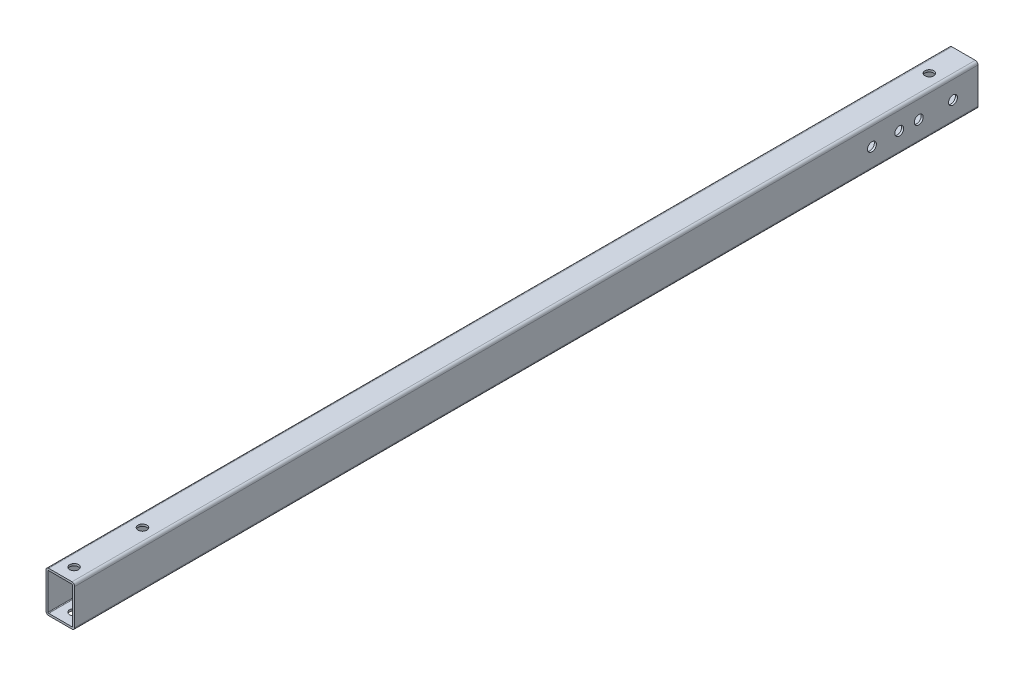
ISO-10303-21;
HEADER;
FILE_DESCRIPTION(('STEP AP214'),'2;1');
FILE_NAME('part.step','',(''),(''),'','','');
FILE_SCHEMA(('AUTOMOTIVE_DESIGN { 1 0 10303 214 1 1 1 1 }'));
ENDSEC;
DATA;
#1=APPLICATION_CONTEXT('core data for automotive mechanical design processes');
#2=APPLICATION_PROTOCOL_DEFINITION('international standard','automotive_design',2000,#1);
#3=PRODUCT_CONTEXT('',#1,'mechanical');
#4=PRODUCT('Part','Part','',(#3));
#5=PRODUCT_RELATED_PRODUCT_CATEGORY('part','',(#4));
#6=PRODUCT_DEFINITION_FORMATION('','',#4);
#7=PRODUCT_DEFINITION_CONTEXT('part definition',#1,'design');
#8=PRODUCT_DEFINITION('design','',#6,#7);
#9=PRODUCT_DEFINITION_SHAPE('','',#8);
#10=(LENGTH_UNIT() NAMED_UNIT(*) SI_UNIT(.MILLI.,.METRE.));
#11=(NAMED_UNIT(*) PLANE_ANGLE_UNIT() SI_UNIT($,.RADIAN.));
#12=(NAMED_UNIT(*) SI_UNIT($,.STERADIAN.) SOLID_ANGLE_UNIT());
#13=UNCERTAINTY_MEASURE_WITH_UNIT(LENGTH_MEASURE(1.E-05),#10,'distance_accuracy_value','');
#14=(GEOMETRIC_REPRESENTATION_CONTEXT(3) GLOBAL_UNCERTAINTY_ASSIGNED_CONTEXT((#13)) GLOBAL_UNIT_ASSIGNED_CONTEXT((#10,
#11,#12)) REPRESENTATION_CONTEXT('',''));
#15=CARTESIAN_POINT('',(0.,0.,0.));
#16=DIRECTION('',(0.,0.,1.));
#17=DIRECTION('',(1.,0.,0.));
#18=AXIS2_PLACEMENT_3D('',#15,#16,#17);
#19=CARTESIAN_POINT('',(-94.5000000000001,-13.,-660.));
#20=DIRECTION('',(0.,0.,1.));
#21=DIRECTION('',(1.,0.,0.));
#22=AXIS2_PLACEMENT_3D('',#19,#20,#21);
#23=CYLINDRICAL_SURFACE('',#22,2.);
#24=CARTESIAN_POINT('',(-94.5000000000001,-13.,0.));
#25=DIRECTION('',(0.,0.,1.));
#26=DIRECTION('',(-1.,0.,0.));
#27=AXIS2_PLACEMENT_3D('',#24,#25,#26);
#28=CIRCLE('',#27,2.);
#29=CARTESIAN_POINT('',(-96.5000000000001,-13.,0.));
#30=VERTEX_POINT('',#29);
#31=CARTESIAN_POINT('',(-94.5000000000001,-15.,0.));
#32=VERTEX_POINT('',#31);
#33=EDGE_CURVE('E201',#30,#32,#28,.T.);
#34=ORIENTED_EDGE('',*,*,#33,.F.);
#35=DIRECTION('',(0.,0.,1.));
#36=VECTOR('',#35,1.);
#37=CARTESIAN_POINT('',(-96.5000000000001,-13.,-660.));
#38=LINE('',#37,#36);
#39=CARTESIAN_POINT('',(-96.5000000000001,-13.,-660.));
#40=VERTEX_POINT('',#39);
#41=EDGE_CURVE('E11',#40,#30,#38,.T.);
#42=ORIENTED_EDGE('',*,*,#41,.F.);
#43=CARTESIAN_POINT('',(-94.5000000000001,-13.,-660.));
#44=DIRECTION('',(0.,0.,1.));
#45=DIRECTION('',(-1.,0.,0.));
#46=AXIS2_PLACEMENT_3D('',#43,#44,#45);
#47=CIRCLE('',#46,2.);
#48=CARTESIAN_POINT('',(-94.5000000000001,-15.,-660.));
#49=VERTEX_POINT('',#48);
#50=EDGE_CURVE('E235',#40,#49,#47,.T.);
#51=ORIENTED_EDGE('',*,*,#50,.T.);
#52=DIRECTION('',(0.,0.,1.));
#53=VECTOR('',#52,1.);
#54=CARTESIAN_POINT('',(-94.5000000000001,-15.,-660.));
#55=LINE('',#54,#53);
#56=EDGE_CURVE('E258',#49,#32,#55,.T.);
#57=ORIENTED_EDGE('',*,*,#56,.T.);
#58=EDGE_LOOP('',(#34,#42,#51,#57));
#59=FACE_BOUND('',#58,.T.);
#60=ADVANCED_FACE('F29',(#59),#23,.T.);
#61=CARTESIAN_POINT('',(-96.5000000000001,-13.,-660.));
#62=DIRECTION('',(-1.,0.,0.));
#63=DIRECTION('',(0.,0.,1.));
#64=AXIS2_PLACEMENT_3D('',#61,#62,#63);
#65=PLANE('',#64);
#66=CARTESIAN_POINT('',(-96.5000000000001,0.,-582.5));
#67=DIRECTION('',(-1.,0.,0.));
#68=DIRECTION('',(0.,0.,1.));
#69=AXIS2_PLACEMENT_3D('',#66,#67,#68);
#70=CIRCLE('',#69,3.24999999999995);
#71=CARTESIAN_POINT('',(-96.5000000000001,0.,-579.25));
#72=VERTEX_POINT('',#71);
#73=EDGE_CURVE('E325',#72,#72,#70,.T.);
#74=ORIENTED_EDGE('',*,*,#73,.F.);
#75=EDGE_LOOP('',(#74));
#76=FACE_BOUND('',#75,.T.);
#77=CARTESIAN_POINT('',(-96.5,0.,-602.5));
#78=DIRECTION('',(-1.,0.,0.));
#79=DIRECTION('',(0.,0.,1.));
#80=AXIS2_PLACEMENT_3D('',#77,#78,#79);
#81=CIRCLE('',#80,3.24999999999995);
#82=CARTESIAN_POINT('',(-96.5,0.,-599.25));
#83=VERTEX_POINT('',#82);
#84=EDGE_CURVE('E332',#83,#83,#81,.T.);
#85=ORIENTED_EDGE('',*,*,#84,.F.);
#86=EDGE_LOOP('',(#85));
#87=FACE_BOUND('',#86,.T.);
#88=CARTESIAN_POINT('',(-96.5000000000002,0.,-616.710580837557));
#89=DIRECTION('',(-1.,0.,0.));
#90=DIRECTION('',(0.,0.,1.));
#91=AXIS2_PLACEMENT_3D('',#88,#89,#90);
#92=CIRCLE('',#91,3.24999999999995);
#93=CARTESIAN_POINT('',(-96.5000000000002,0.,-613.460580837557));
#94=VERTEX_POINT('',#93);
#95=EDGE_CURVE('E339',#94,#94,#92,.T.);
#96=ORIENTED_EDGE('',*,*,#95,.F.);
#97=EDGE_LOOP('',(#96));
#98=FACE_BOUND('',#97,.T.);
#99=CARTESIAN_POINT('',(-96.5000000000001,0.,-641.710580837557));
#100=DIRECTION('',(-1.,0.,0.));
#101=DIRECTION('',(0.,0.,1.));
#102=AXIS2_PLACEMENT_3D('',#99,#100,#101);
#103=CIRCLE('',#102,3.24999999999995);
#104=CARTESIAN_POINT('',(-96.5000000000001,0.,-638.460580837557));
#105=VERTEX_POINT('',#104);
#106=EDGE_CURVE('E346',#105,#105,#103,.T.);
#107=ORIENTED_EDGE('',*,*,#106,.F.);
#108=EDGE_LOOP('',(#107));
#109=FACE_BOUND('',#108,.T.);
#110=DIRECTION('',(0.,-1.,0.));
#111=VECTOR('',#110,1.);
#112=CARTESIAN_POINT('',(-96.5000000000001,-13.,0.));
#113=LINE('',#112,#111);
#114=CARTESIAN_POINT('',(-96.5000000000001,13.,0.));
#115=VERTEX_POINT('',#114);
#116=EDGE_CURVE('E232',#115,#30,#113,.T.);
#117=ORIENTED_EDGE('',*,*,#116,.F.);
#118=DIRECTION('',(0.,0.,1.));
#119=VECTOR('',#118,1.);
#120=CARTESIAN_POINT('',(-96.5000000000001,13.,-660.));
#121=LINE('',#120,#119);
#122=CARTESIAN_POINT('',(-96.5000000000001,13.,-660.));
#123=VERTEX_POINT('',#122);
#124=EDGE_CURVE('E37',#123,#115,#121,.T.);
#125=ORIENTED_EDGE('',*,*,#124,.F.);
#126=DIRECTION('',(0.,-1.,0.));
#127=VECTOR('',#126,1.);
#128=CARTESIAN_POINT('',(-96.5000000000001,-13.,-660.));
#129=LINE('',#128,#127);
#130=EDGE_CURVE('E256',#123,#40,#129,.T.);
#131=ORIENTED_EDGE('',*,*,#130,.T.);
#132=ORIENTED_EDGE('',*,*,#41,.T.);
#133=EDGE_LOOP('',(#117,#125,#131,#132));
#134=FACE_BOUND('',#133,.T.);
#135=ADVANCED_FACE('F353',(#76,#87,#98,#109,#134),#65,.T.);
#136=CARTESIAN_POINT('',(-94.5000000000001,13.,-660.));
#137=DIRECTION('',(0.,0.,1.));
#138=DIRECTION('',(1.,0.,0.));
#139=AXIS2_PLACEMENT_3D('',#136,#137,#138);
#140=CYLINDRICAL_SURFACE('',#139,2.);
#141=CARTESIAN_POINT('',(-94.5000000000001,13.,0.));
#142=DIRECTION('',(0.,0.,1.));
#143=DIRECTION('',(-1.,0.,0.));
#144=AXIS2_PLACEMENT_3D('',#141,#142,#143);
#145=CIRCLE('',#144,2.);
#146=CARTESIAN_POINT('',(-94.5000000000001,15.,0.));
#147=VERTEX_POINT('',#146);
#148=EDGE_CURVE('E229',#147,#115,#145,.T.);
#149=ORIENTED_EDGE('',*,*,#148,.F.);
#150=DIRECTION('',(0.,0.,1.));
#151=VECTOR('',#150,1.);
#152=CARTESIAN_POINT('',(-94.5000000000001,15.,-660.));
#153=LINE('',#152,#151);
#154=CARTESIAN_POINT('',(-94.5000000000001,15.,-660.));
#155=VERTEX_POINT('',#154);
#156=EDGE_CURVE('E261',#155,#147,#153,.T.);
#157=ORIENTED_EDGE('',*,*,#156,.F.);
#158=CARTESIAN_POINT('',(-94.5000000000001,13.,-660.));
#159=DIRECTION('',(0.,0.,1.));
#160=DIRECTION('',(-1.,0.,0.));
#161=AXIS2_PLACEMENT_3D('',#158,#159,#160);
#162=CIRCLE('',#161,2.);
#163=EDGE_CURVE('E253',#155,#123,#162,.T.);
#164=ORIENTED_EDGE('',*,*,#163,.T.);
#165=ORIENTED_EDGE('',*,*,#124,.T.);
#166=EDGE_LOOP('',(#149,#157,#164,#165));
#167=FACE_BOUND('',#166,.T.);
#168=ADVANCED_FACE('F356',(#167),#140,.T.);
#169=CARTESIAN_POINT('',(-77.5000000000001,15.,-660.));
#170=DIRECTION('',(0.,1.,0.));
#171=DIRECTION('',(0.,0.,1.));
#172=AXIS2_PLACEMENT_3D('',#169,#170,#171);
#173=PLANE('',#172);
#174=CARTESIAN_POINT('',(-86.,15.,-635.));
#175=DIRECTION('',(0.,1.,0.));
#176=DIRECTION('',(0.,0.,1.));
#177=AXIS2_PLACEMENT_3D('',#174,#175,#176);
#178=CIRCLE('',#177,3.24999999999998);
#179=CARTESIAN_POINT('',(-86.,15.,-631.75));
#180=VERTEX_POINT('',#179);
#181=EDGE_CURVE('E683',#180,#180,#178,.T.);
#182=ORIENTED_EDGE('',*,*,#181,.F.);
#183=EDGE_LOOP('',(#182));
#184=FACE_BOUND('',#183,.T.);
#185=CARTESIAN_POINT('',(-85.9999999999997,15.,-60.));
#186=DIRECTION('',(0.,1.,0.));
#187=DIRECTION('',(0.,0.,1.));
#188=AXIS2_PLACEMENT_3D('',#185,#186,#187);
#189=CIRCLE('',#188,3.25000000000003);
#190=CARTESIAN_POINT('',(-85.9999999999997,15.,-56.75));
#191=VERTEX_POINT('',#190);
#192=EDGE_CURVE('E306',#191,#191,#189,.T.);
#193=ORIENTED_EDGE('',*,*,#192,.F.);
#194=EDGE_LOOP('',(#193));
#195=FACE_BOUND('',#194,.T.);
#196=CARTESIAN_POINT('',(-86.,15.,-9.9999999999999));
#197=DIRECTION('',(0.,1.,0.));
#198=DIRECTION('',(0.,0.,1.));
#199=AXIS2_PLACEMENT_3D('',#196,#197,#198);
#200=CIRCLE('',#199,3.25);
#201=CARTESIAN_POINT('',(-86.,15.,-6.7499999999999));
#202=VERTEX_POINT('',#201);
#203=EDGE_CURVE('E303',#202,#202,#200,.T.);
#204=ORIENTED_EDGE('',*,*,#203,.F.);
#205=EDGE_LOOP('',(#204));
#206=FACE_BOUND('',#205,.T.);
#207=DIRECTION('',(-1.,0.,0.));
#208=VECTOR('',#207,1.);
#209=CARTESIAN_POINT('',(-77.5000000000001,15.,0.));
#210=LINE('',#209,#208);
#211=CARTESIAN_POINT('',(-77.5000000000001,15.,0.));
#212=VERTEX_POINT('',#211);
#213=EDGE_CURVE('E226',#212,#147,#210,.T.);
#214=ORIENTED_EDGE('',*,*,#213,.F.);
#215=DIRECTION('',(0.,0.,1.));
#216=VECTOR('',#215,1.);
#217=CARTESIAN_POINT('',(-77.5000000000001,15.,-660.));
#218=LINE('',#217,#216);
#219=CARTESIAN_POINT('',(-77.5000000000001,15.,-660.));
#220=VERTEX_POINT('',#219);
#221=EDGE_CURVE('E263',#220,#212,#218,.T.);
#222=ORIENTED_EDGE('',*,*,#221,.F.);
#223=DIRECTION('',(-1.,0.,0.));
#224=VECTOR('',#223,1.);
#225=CARTESIAN_POINT('',(-77.5000000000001,15.,-660.));
#226=LINE('',#225,#224);
#227=EDGE_CURVE('E250',#220,#155,#226,.T.);
#228=ORIENTED_EDGE('',*,*,#227,.T.);
#229=ORIENTED_EDGE('',*,*,#156,.T.);
#230=EDGE_LOOP('',(#214,#222,#228,#229));
#231=FACE_BOUND('',#230,.T.);
#232=ADVANCED_FACE('F388',(#184,#195,#206,#231),#173,.T.);
#233=CARTESIAN_POINT('',(-77.5000000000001,13.,-660.));
#234=DIRECTION('',(0.,0.,1.));
#235=DIRECTION('',(1.,0.,0.));
#236=AXIS2_PLACEMENT_3D('',#233,#234,#235);
#237=CYLINDRICAL_SURFACE('',#236,2.);
#238=CARTESIAN_POINT('',(-77.5000000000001,13.,0.));
#239=DIRECTION('',(0.,0.,1.));
#240=DIRECTION('',(-1.,0.,0.));
#241=AXIS2_PLACEMENT_3D('',#238,#239,#240);
#242=CIRCLE('',#241,2.);
#243=CARTESIAN_POINT('',(-75.5000000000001,13.,0.));
#244=VERTEX_POINT('',#243);
#245=EDGE_CURVE('E223',#244,#212,#242,.T.);
#246=ORIENTED_EDGE('',*,*,#245,.F.);
#247=DIRECTION('',(0.,0.,1.));
#248=VECTOR('',#247,1.);
#249=CARTESIAN_POINT('',(-75.5000000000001,13.,-660.));
#250=LINE('',#249,#248);
#251=CARTESIAN_POINT('',(-75.5000000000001,13.,-660.));
#252=VERTEX_POINT('',#251);
#253=EDGE_CURVE('E265',#252,#244,#250,.T.);
#254=ORIENTED_EDGE('',*,*,#253,.F.);
#255=CARTESIAN_POINT('',(-77.5000000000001,13.,-660.));
#256=DIRECTION('',(0.,0.,1.));
#257=DIRECTION('',(-1.,0.,0.));
#258=AXIS2_PLACEMENT_3D('',#255,#256,#257);
#259=CIRCLE('',#258,2.);
#260=EDGE_CURVE('E247',#252,#220,#259,.T.);
#261=ORIENTED_EDGE('',*,*,#260,.T.);
#262=ORIENTED_EDGE('',*,*,#221,.T.);
#263=EDGE_LOOP('',(#246,#254,#261,#262));
#264=FACE_BOUND('',#263,.T.);
#265=ADVANCED_FACE('F386',(#264),#237,.T.);
#266=CARTESIAN_POINT('',(-75.5000000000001,-13.,-660.));
#267=DIRECTION('',(1.,0.,0.));
#268=DIRECTION('',(0.,1.,0.));
#269=AXIS2_PLACEMENT_3D('',#266,#267,#268);
#270=PLANE('',#269);
#271=CARTESIAN_POINT('',(-75.5000000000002,0.,-582.5));
#272=DIRECTION('',(1.,0.,0.));
#273=DIRECTION('',(0.,1.,0.));
#274=AXIS2_PLACEMENT_3D('',#271,#272,#273);
#275=CIRCLE('',#274,3.24999999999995);
#276=CARTESIAN_POINT('',(-75.5000000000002,3.24999999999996,-582.5));
#277=VERTEX_POINT('',#276);
#278=EDGE_CURVE('E291',#277,#277,#275,.T.);
#279=ORIENTED_EDGE('',*,*,#278,.F.);
#280=EDGE_LOOP('',(#279));
#281=FACE_BOUND('',#280,.T.);
#282=CARTESIAN_POINT('',(-75.5,0.,-602.5));
#283=DIRECTION('',(1.,0.,0.));
#284=DIRECTION('',(0.,1.,0.));
#285=AXIS2_PLACEMENT_3D('',#282,#283,#284);
#286=CIRCLE('',#285,3.24999999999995);
#287=CARTESIAN_POINT('',(-75.5,3.24999999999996,-602.5));
#288=VERTEX_POINT('',#287);
#289=EDGE_CURVE('E286',#288,#288,#286,.T.);
#290=ORIENTED_EDGE('',*,*,#289,.F.);
#291=EDGE_LOOP('',(#290));
#292=FACE_BOUND('',#291,.T.);
#293=CARTESIAN_POINT('',(-75.5000000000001,0.,-616.710580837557));
#294=DIRECTION('',(1.,0.,0.));
#295=DIRECTION('',(0.,1.,0.));
#296=AXIS2_PLACEMENT_3D('',#293,#294,#295);
#297=CIRCLE('',#296,3.24999999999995);
#298=CARTESIAN_POINT('',(-75.5000000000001,3.24999999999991,-616.710580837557));
#299=VERTEX_POINT('',#298);
#300=EDGE_CURVE('E281',#299,#299,#297,.T.);
#301=ORIENTED_EDGE('',*,*,#300,.F.);
#302=EDGE_LOOP('',(#301));
#303=FACE_BOUND('',#302,.T.);
#304=CARTESIAN_POINT('',(-75.5000000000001,0.,-641.710580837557));
#305=DIRECTION('',(1.,0.,0.));
#306=DIRECTION('',(0.,1.,0.));
#307=AXIS2_PLACEMENT_3D('',#304,#305,#306);
#308=CIRCLE('',#307,3.24999999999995);
#309=CARTESIAN_POINT('',(-75.5000000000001,3.24999999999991,-641.710580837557));
#310=VERTEX_POINT('',#309);
#311=EDGE_CURVE('E276',#310,#310,#308,.T.);
#312=ORIENTED_EDGE('',*,*,#311,.F.);
#313=EDGE_LOOP('',(#312));
#314=FACE_BOUND('',#313,.T.);
#315=DIRECTION('',(0.,1.,0.));
#316=VECTOR('',#315,1.);
#317=CARTESIAN_POINT('',(-75.5000000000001,-13.,0.));
#318=LINE('',#317,#316);
#319=CARTESIAN_POINT('',(-75.5000000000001,-13.,0.));
#320=VERTEX_POINT('',#319);
#321=EDGE_CURVE('E220',#320,#244,#318,.T.);
#322=ORIENTED_EDGE('',*,*,#321,.F.);
#323=DIRECTION('',(0.,0.,1.));
#324=VECTOR('',#323,1.);
#325=CARTESIAN_POINT('',(-75.5000000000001,-13.,-660.));
#326=LINE('',#325,#324);
#327=CARTESIAN_POINT('',(-75.5000000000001,-13.,-660.));
#328=VERTEX_POINT('',#327);
#329=EDGE_CURVE('E267',#328,#320,#326,.T.);
#330=ORIENTED_EDGE('',*,*,#329,.F.);
#331=DIRECTION('',(0.,1.,0.));
#332=VECTOR('',#331,1.);
#333=CARTESIAN_POINT('',(-75.5000000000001,-13.,-660.));
#334=LINE('',#333,#332);
#335=EDGE_CURVE('E244',#328,#252,#334,.T.);
#336=ORIENTED_EDGE('',*,*,#335,.T.);
#337=ORIENTED_EDGE('',*,*,#253,.T.);
#338=EDGE_LOOP('',(#322,#330,#336,#337));
#339=FACE_BOUND('',#338,.T.);
#340=ADVANCED_FACE('F382',(#281,#292,#303,#314,#339),#270,.T.);
#341=CARTESIAN_POINT('',(-77.5000000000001,-13.,-660.));
#342=DIRECTION('',(0.,0.,1.));
#343=DIRECTION('',(1.,0.,0.));
#344=AXIS2_PLACEMENT_3D('',#341,#342,#343);
#345=CYLINDRICAL_SURFACE('',#344,2.);
#346=CARTESIAN_POINT('',(-77.5000000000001,-13.,0.));
#347=DIRECTION('',(0.,0.,1.));
#348=DIRECTION('',(-1.,0.,0.));
#349=AXIS2_PLACEMENT_3D('',#346,#347,#348);
#350=CIRCLE('',#349,2.);
#351=CARTESIAN_POINT('',(-77.5000000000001,-15.,0.));
#352=VERTEX_POINT('',#351);
#353=EDGE_CURVE('E217',#352,#320,#350,.T.);
#354=ORIENTED_EDGE('',*,*,#353,.F.);
#355=DIRECTION('',(0.,0.,1.));
#356=VECTOR('',#355,1.);
#357=CARTESIAN_POINT('',(-77.5000000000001,-15.,-660.));
#358=LINE('',#357,#356);
#359=CARTESIAN_POINT('',(-77.5000000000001,-15.,-660.));
#360=VERTEX_POINT('',#359);
#361=EDGE_CURVE('E269',#360,#352,#358,.T.);
#362=ORIENTED_EDGE('',*,*,#361,.F.);
#363=CARTESIAN_POINT('',(-77.5000000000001,-13.,-660.));
#364=DIRECTION('',(0.,0.,1.));
#365=DIRECTION('',(-1.,0.,0.));
#366=AXIS2_PLACEMENT_3D('',#363,#364,#365);
#367=CIRCLE('',#366,2.);
#368=EDGE_CURVE('E241',#360,#328,#367,.T.);
#369=ORIENTED_EDGE('',*,*,#368,.T.);
#370=ORIENTED_EDGE('',*,*,#329,.T.);
#371=EDGE_LOOP('',(#354,#362,#369,#370));
#372=FACE_BOUND('',#371,.T.);
#373=ADVANCED_FACE('F379',(#372),#345,.T.);
#374=CARTESIAN_POINT('',(-77.5000000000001,-15.,-660.));
#375=DIRECTION('',(0.,-1.,0.));
#376=DIRECTION('',(1.,0.,0.));
#377=AXIS2_PLACEMENT_3D('',#374,#375,#376);
#378=PLANE('',#377);
#379=CARTESIAN_POINT('',(-86.,-15.,-635.));
#380=DIRECTION('',(0.,1.,0.));
#381=DIRECTION('',(0.,0.,1.));
#382=AXIS2_PLACEMENT_3D('',#379,#380,#381);
#383=CIRCLE('',#382,3.24999999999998);
#384=CARTESIAN_POINT('',(-86.,-15.,-631.75));
#385=VERTEX_POINT('',#384);
#386=EDGE_CURVE('E677',#385,#385,#383,.T.);
#387=ORIENTED_EDGE('',*,*,#386,.T.);
#388=EDGE_LOOP('',(#387));
#389=FACE_BOUND('',#388,.T.);
#390=CARTESIAN_POINT('',(-85.9999999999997,-15.,-60.));
#391=DIRECTION('',(0.,1.,0.));
#392=DIRECTION('',(0.,0.,1.));
#393=AXIS2_PLACEMENT_3D('',#390,#391,#392);
#394=CIRCLE('',#393,3.25000000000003);
#395=CARTESIAN_POINT('',(-85.9999999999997,-15.,-56.75));
#396=VERTEX_POINT('',#395);
#397=EDGE_CURVE('E299',#396,#396,#394,.T.);
#398=ORIENTED_EDGE('',*,*,#397,.T.);
#399=EDGE_LOOP('',(#398));
#400=FACE_BOUND('',#399,.T.);
#401=CARTESIAN_POINT('',(-86.,-15.,-9.9999999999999));
#402=DIRECTION('',(0.,1.,0.));
#403=DIRECTION('',(0.,0.,1.));
#404=AXIS2_PLACEMENT_3D('',#401,#402,#403);
#405=CIRCLE('',#404,3.25);
#406=CARTESIAN_POINT('',(-86.,-15.,-6.7499999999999));
#407=VERTEX_POINT('',#406);
#408=EDGE_CURVE('E295',#407,#407,#405,.T.);
#409=ORIENTED_EDGE('',*,*,#408,.T.);
#410=EDGE_LOOP('',(#409));
#411=FACE_BOUND('',#410,.T.);
#412=DIRECTION('',(1.,0.,0.));
#413=VECTOR('',#412,1.);
#414=CARTESIAN_POINT('',(-77.5000000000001,-15.,0.));
#415=LINE('',#414,#413);
#416=EDGE_CURVE('E214',#32,#352,#415,.T.);
#417=ORIENTED_EDGE('',*,*,#416,.F.);
#418=ORIENTED_EDGE('',*,*,#56,.F.);
#419=DIRECTION('',(1.,0.,0.));
#420=VECTOR('',#419,1.);
#421=CARTESIAN_POINT('',(-77.5000000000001,-15.,-660.));
#422=LINE('',#421,#420);
#423=EDGE_CURVE('E238',#49,#360,#422,.T.);
#424=ORIENTED_EDGE('',*,*,#423,.T.);
#425=ORIENTED_EDGE('',*,*,#361,.T.);
#426=EDGE_LOOP('',(#417,#418,#424,#425));
#427=FACE_BOUND('',#426,.T.);
#428=ADVANCED_FACE('F375',(#389,#400,#411,#427),#378,.T.);
#429=CARTESIAN_POINT('',(-94.5000000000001,-13.,-660.));
#430=DIRECTION('',(0.,0.,-1.));
#431=DIRECTION('',(-1.,0.,0.));
#432=AXIS2_PLACEMENT_3D('',#429,#430,#431);
#433=PLANE('',#432);
#434=CARTESIAN_POINT('',(-77.5000000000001,-13.,-660.));
#435=DIRECTION('',(0.,0.,1.));
#436=DIRECTION('',(-1.,0.,0.));
#437=AXIS2_PLACEMENT_3D('',#434,#435,#436);
#438=CIRCLE('',#437,0.5);
#439=CARTESIAN_POINT('',(-77.5000000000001,-13.5,-660.));
#440=VERTEX_POINT('',#439);
#441=CARTESIAN_POINT('',(-77.0000000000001,-13.,-660.));
#442=VERTEX_POINT('',#441);
#443=EDGE_CURVE('E178',#440,#442,#438,.T.);
#444=ORIENTED_EDGE('',*,*,#443,.T.);
#445=DIRECTION('',(0.,1.,0.));
#446=VECTOR('',#445,1.);
#447=CARTESIAN_POINT('',(-77.0000000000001,-13.,-660.));
#448=LINE('',#447,#446);
#449=CARTESIAN_POINT('',(-77.0000000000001,13.,-660.));
#450=VERTEX_POINT('',#449);
#451=EDGE_CURVE('E181',#442,#450,#448,.T.);
#452=ORIENTED_EDGE('',*,*,#451,.T.);
#453=CARTESIAN_POINT('',(-77.5000000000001,13.,-660.));
#454=DIRECTION('',(0.,0.,1.));
#455=DIRECTION('',(-1.,0.,0.));
#456=AXIS2_PLACEMENT_3D('',#453,#454,#455);
#457=CIRCLE('',#456,0.499999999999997);
#458=CARTESIAN_POINT('',(-77.5000000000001,13.5,-660.));
#459=VERTEX_POINT('',#458);
#460=EDGE_CURVE('E45',#450,#459,#457,.T.);
#461=ORIENTED_EDGE('',*,*,#460,.T.);
#462=DIRECTION('',(-1.,0.,0.));
#463=VECTOR('',#462,1.);
#464=CARTESIAN_POINT('',(-77.5000000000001,13.5,-660.));
#465=LINE('',#464,#463);
#466=CARTESIAN_POINT('',(-94.5000000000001,13.5,-660.));
#467=VERTEX_POINT('',#466);
#468=EDGE_CURVE('E184',#459,#467,#465,.T.);
#469=ORIENTED_EDGE('',*,*,#468,.T.);
#470=CARTESIAN_POINT('',(-94.5000000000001,13.,-660.));
#471=DIRECTION('',(0.,0.,1.));
#472=DIRECTION('',(-1.,0.,0.));
#473=AXIS2_PLACEMENT_3D('',#470,#471,#472);
#474=CIRCLE('',#473,0.5);
#475=CARTESIAN_POINT('',(-95.0000000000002,13.,-660.));
#476=VERTEX_POINT('',#475);
#477=EDGE_CURVE('E187',#467,#476,#474,.T.);
#478=ORIENTED_EDGE('',*,*,#477,.T.);
#479=DIRECTION('',(0.,-1.,0.));
#480=VECTOR('',#479,1.);
#481=CARTESIAN_POINT('',(-95.0000000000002,-13.,-660.));
#482=LINE('',#481,#480);
#483=CARTESIAN_POINT('',(-95.0000000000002,-13.,-660.));
#484=VERTEX_POINT('',#483);
#485=EDGE_CURVE('E190',#476,#484,#482,.T.);
#486=ORIENTED_EDGE('',*,*,#485,.T.);
#487=CARTESIAN_POINT('',(-94.5000000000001,-13.,-660.));
#488=DIRECTION('',(0.,0.,1.));
#489=DIRECTION('',(-1.,0.,0.));
#490=AXIS2_PLACEMENT_3D('',#487,#488,#489);
#491=CIRCLE('',#490,0.5);
#492=CARTESIAN_POINT('',(-94.5000000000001,-13.5,-660.));
#493=VERTEX_POINT('',#492);
#494=EDGE_CURVE('E193',#484,#493,#491,.T.);
#495=ORIENTED_EDGE('',*,*,#494,.T.);
#496=DIRECTION('',(1.,0.,0.));
#497=VECTOR('',#496,1.);
#498=CARTESIAN_POINT('',(-77.5000000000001,-13.5,-660.));
#499=LINE('',#498,#497);
#500=EDGE_CURVE('E196',#493,#440,#499,.T.);
#501=ORIENTED_EDGE('',*,*,#500,.T.);
#502=EDGE_LOOP('',(#444,#452,#461,#469,#478,#486,#495,#501));
#503=FACE_BOUND('',#502,.T.);
#504=ORIENTED_EDGE('',*,*,#50,.F.);
#505=ORIENTED_EDGE('',*,*,#130,.F.);
#506=ORIENTED_EDGE('',*,*,#163,.F.);
#507=ORIENTED_EDGE('',*,*,#227,.F.);
#508=ORIENTED_EDGE('',*,*,#260,.F.);
#509=ORIENTED_EDGE('',*,*,#335,.F.);
#510=ORIENTED_EDGE('',*,*,#368,.F.);
#511=ORIENTED_EDGE('',*,*,#423,.F.);
#512=EDGE_LOOP('',(#504,#505,#506,#507,#508,#509,#510,#511));
#513=FACE_BOUND('',#512,.T.);
#514=ADVANCED_FACE('F369',(#503,#513),#433,.T.);
#515=CARTESIAN_POINT('',(-94.5000000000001,-13.,0.));
#516=DIRECTION('',(0.,0.,-1.));
#517=DIRECTION('',(-1.,0.,0.));
#518=AXIS2_PLACEMENT_3D('',#515,#516,#517);
#519=PLANE('',#518);
#520=DIRECTION('',(0.,1.,0.));
#521=VECTOR('',#520,1.);
#522=CARTESIAN_POINT('',(-77.,-13.,0.));
#523=LINE('',#522,#521);
#524=CARTESIAN_POINT('',(-77.,-13.,0.));
#525=VERTEX_POINT('',#524);
#526=CARTESIAN_POINT('',(-77.,13.,0.));
#527=VERTEX_POINT('',#526);
#528=EDGE_CURVE('E153',#525,#527,#523,.T.);
#529=ORIENTED_EDGE('',*,*,#528,.F.);
#530=CARTESIAN_POINT('',(-77.5000000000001,-13.,0.));
#531=DIRECTION('',(0.,0.,1.));
#532=DIRECTION('',(-1.,0.,0.));
#533=AXIS2_PLACEMENT_3D('',#530,#531,#532);
#534=CIRCLE('',#533,0.5);
#535=CARTESIAN_POINT('',(-77.5000000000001,-13.5,0.));
#536=VERTEX_POINT('',#535);
#537=EDGE_CURVE('E53',#536,#525,#534,.T.);
#538=ORIENTED_EDGE('',*,*,#537,.F.);
#539=DIRECTION('',(1.,0.,0.));
#540=VECTOR('',#539,1.);
#541=CARTESIAN_POINT('',(-77.5000000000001,-13.5,0.));
#542=LINE('',#541,#540);
#543=CARTESIAN_POINT('',(-94.5000000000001,-13.5,0.));
#544=VERTEX_POINT('',#543);
#545=EDGE_CURVE('E175',#544,#536,#542,.T.);
#546=ORIENTED_EDGE('',*,*,#545,.F.);
#547=CARTESIAN_POINT('',(-94.5000000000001,-13.,0.));
#548=DIRECTION('',(0.,0.,1.));
#549=DIRECTION('',(-1.,0.,0.));
#550=AXIS2_PLACEMENT_3D('',#547,#548,#549);
#551=CIRCLE('',#550,0.5);
#552=CARTESIAN_POINT('',(-95.,-13.,0.));
#553=VERTEX_POINT('',#552);
#554=EDGE_CURVE('E172',#553,#544,#551,.T.);
#555=ORIENTED_EDGE('',*,*,#554,.F.);
#556=DIRECTION('',(0.,-1.,0.));
#557=VECTOR('',#556,1.);
#558=CARTESIAN_POINT('',(-95.,-13.,0.));
#559=LINE('',#558,#557);
#560=CARTESIAN_POINT('',(-95.,13.,0.));
#561=VERTEX_POINT('',#560);
#562=EDGE_CURVE('E169',#561,#553,#559,.T.);
#563=ORIENTED_EDGE('',*,*,#562,.F.);
#564=CARTESIAN_POINT('',(-94.5000000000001,13.,0.));
#565=DIRECTION('',(0.,0.,1.));
#566=DIRECTION('',(-1.,0.,0.));
#567=AXIS2_PLACEMENT_3D('',#564,#565,#566);
#568=CIRCLE('',#567,0.5);
#569=CARTESIAN_POINT('',(-94.5000000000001,13.5,0.));
#570=VERTEX_POINT('',#569);
#571=EDGE_CURVE('E163',#570,#561,#568,.T.);
#572=ORIENTED_EDGE('',*,*,#571,.F.);
#573=DIRECTION('',(-1.,0.,0.));
#574=VECTOR('',#573,1.);
#575=CARTESIAN_POINT('',(-77.5000000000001,13.5,0.));
#576=LINE('',#575,#574);
#577=CARTESIAN_POINT('',(-77.5000000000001,13.5,0.));
#578=VERTEX_POINT('',#577);
#579=EDGE_CURVE('E161',#578,#570,#576,.T.);
#580=ORIENTED_EDGE('',*,*,#579,.F.);
#581=CARTESIAN_POINT('',(-77.5000000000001,13.,0.));
#582=DIRECTION('',(0.,0.,1.));
#583=DIRECTION('',(-1.,0.,0.));
#584=AXIS2_PLACEMENT_3D('',#581,#582,#583);
#585=CIRCLE('',#584,0.499999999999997);
#586=EDGE_CURVE('E144',#527,#578,#585,.T.);
#587=ORIENTED_EDGE('',*,*,#586,.F.);
#588=EDGE_LOOP('',(#529,#538,#546,#555,#563,#572,#580,#587));
#589=FACE_BOUND('',#588,.T.);
#590=ORIENTED_EDGE('',*,*,#33,.T.);
#591=ORIENTED_EDGE('',*,*,#416,.T.);
#592=ORIENTED_EDGE('',*,*,#353,.T.);
#593=ORIENTED_EDGE('',*,*,#321,.T.);
#594=ORIENTED_EDGE('',*,*,#245,.T.);
#595=ORIENTED_EDGE('',*,*,#213,.T.);
#596=ORIENTED_EDGE('',*,*,#148,.T.);
#597=ORIENTED_EDGE('',*,*,#116,.T.);
#598=EDGE_LOOP('',(#590,#591,#592,#593,#594,#595,#596,#597));
#599=FACE_BOUND('',#598,.T.);
#600=ADVANCED_FACE('F157',(#589,#599),#519,.F.);
#601=CARTESIAN_POINT('',(-77.5000000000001,-13.,-660.));
#602=DIRECTION('',(0.,0.,1.));
#603=DIRECTION('',(1.,0.,0.));
#604=AXIS2_PLACEMENT_3D('',#601,#602,#603);
#605=CYLINDRICAL_SURFACE('',#604,0.5);
#606=ORIENTED_EDGE('',*,*,#537,.T.);
#607=DIRECTION('',(0.,0.,1.));
#608=VECTOR('',#607,1.);
#609=CARTESIAN_POINT('',(-77.0000000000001,-13.,-660.));
#610=LINE('',#609,#608);
#611=EDGE_CURVE('E150',#442,#525,#610,.T.);
#612=ORIENTED_EDGE('',*,*,#611,.F.);
#613=ORIENTED_EDGE('',*,*,#443,.F.);
#614=DIRECTION('',(0.,0.,1.));
#615=VECTOR('',#614,1.);
#616=CARTESIAN_POINT('',(-77.5000000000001,-13.5,-660.));
#617=LINE('',#616,#615);
#618=EDGE_CURVE('E199',#440,#536,#617,.T.);
#619=ORIENTED_EDGE('',*,*,#618,.T.);
#620=EDGE_LOOP('',(#606,#612,#613,#619));
#621=FACE_BOUND('',#620,.T.);
#622=ADVANCED_FACE('F464',(#621),#605,.F.);
#623=CARTESIAN_POINT('',(-77.5000000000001,-13.5,-660.));
#624=DIRECTION('',(0.,-1.,0.));
#625=DIRECTION('',(1.,0.,0.));
#626=AXIS2_PLACEMENT_3D('',#623,#624,#625);
#627=PLANE('',#626);
#628=CARTESIAN_POINT('',(-86.,-13.5,-635.));
#629=DIRECTION('',(0.,-1.,0.));
#630=DIRECTION('',(1.,0.,0.));
#631=AXIS2_PLACEMENT_3D('',#628,#629,#630);
#632=CIRCLE('',#631,3.24999999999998);
#633=CARTESIAN_POINT('',(-82.75,-13.5,-635.));
#634=VERTEX_POINT('',#633);
#635=EDGE_CURVE('E311',#634,#634,#632,.T.);
#636=ORIENTED_EDGE('',*,*,#635,.T.);
#637=EDGE_LOOP('',(#636));
#638=FACE_BOUND('',#637,.T.);
#639=CARTESIAN_POINT('',(-85.9999999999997,-13.5,-60.));
#640=DIRECTION('',(0.,-1.,0.));
#641=DIRECTION('',(1.,0.,0.));
#642=AXIS2_PLACEMENT_3D('',#639,#640,#641);
#643=CIRCLE('',#642,3.25000000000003);
#644=CARTESIAN_POINT('',(-82.7499999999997,-13.5,-60.));
#645=VERTEX_POINT('',#644);
#646=EDGE_CURVE('E298',#645,#645,#643,.T.);
#647=ORIENTED_EDGE('',*,*,#646,.T.);
#648=EDGE_LOOP('',(#647));
#649=FACE_BOUND('',#648,.T.);
#650=CARTESIAN_POINT('',(-86.,-13.5,-9.9999999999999));
#651=DIRECTION('',(0.,-1.,0.));
#652=DIRECTION('',(1.,0.,0.));
#653=AXIS2_PLACEMENT_3D('',#650,#651,#652);
#654=CIRCLE('',#653,3.25);
#655=CARTESIAN_POINT('',(-82.75,-13.5,-9.9999999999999));
#656=VERTEX_POINT('',#655);
#657=EDGE_CURVE('E294',#656,#656,#654,.T.);
#658=ORIENTED_EDGE('',*,*,#657,.T.);
#659=EDGE_LOOP('',(#658));
#660=FACE_BOUND('',#659,.T.);
#661=ORIENTED_EDGE('',*,*,#545,.T.);
#662=ORIENTED_EDGE('',*,*,#618,.F.);
#663=ORIENTED_EDGE('',*,*,#500,.F.);
#664=DIRECTION('',(0.,0.,1.));
#665=VECTOR('',#664,1.);
#666=CARTESIAN_POINT('',(-94.5000000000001,-13.5,-660.));
#667=LINE('',#666,#665);
#668=EDGE_CURVE('E202',#493,#544,#667,.T.);
#669=ORIENTED_EDGE('',*,*,#668,.T.);
#670=EDGE_LOOP('',(#661,#662,#663,#669));
#671=FACE_BOUND('',#670,.T.);
#672=ADVANCED_FACE('F473',(#638,#649,#660,#671),#627,.F.);
#673=CARTESIAN_POINT('',(-94.5000000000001,-13.,-660.));
#674=DIRECTION('',(0.,0.,1.));
#675=DIRECTION('',(1.,0.,0.));
#676=AXIS2_PLACEMENT_3D('',#673,#674,#675);
#677=CYLINDRICAL_SURFACE('',#676,0.5);
#678=ORIENTED_EDGE('',*,*,#554,.T.);
#679=ORIENTED_EDGE('',*,*,#668,.F.);
#680=ORIENTED_EDGE('',*,*,#494,.F.);
#681=DIRECTION('',(0.,0.,1.));
#682=VECTOR('',#681,1.);
#683=CARTESIAN_POINT('',(-95.0000000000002,-13.,-660.));
#684=LINE('',#683,#682);
#685=EDGE_CURVE('E204',#484,#553,#684,.T.);
#686=ORIENTED_EDGE('',*,*,#685,.T.);
#687=EDGE_LOOP('',(#678,#679,#680,#686));
#688=FACE_BOUND('',#687,.T.);
#689=ADVANCED_FACE('F482',(#688),#677,.F.);
#690=CARTESIAN_POINT('',(-95.0000000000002,-13.,-660.));
#691=DIRECTION('',(-1.,0.,0.));
#692=DIRECTION('',(0.,0.,1.));
#693=AXIS2_PLACEMENT_3D('',#690,#691,#692);
#694=PLANE('',#693);
#695=CARTESIAN_POINT('',(-95.0000000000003,0.,-582.5));
#696=DIRECTION('',(-1.,0.,0.));
#697=DIRECTION('',(0.,0.,1.));
#698=AXIS2_PLACEMENT_3D('',#695,#696,#697);
#699=CIRCLE('',#698,3.24999999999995);
#700=CARTESIAN_POINT('',(-95.0000000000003,0.,-579.25));
#701=VERTEX_POINT('',#700);
#702=EDGE_CURVE('E290',#701,#701,#699,.T.);
#703=ORIENTED_EDGE('',*,*,#702,.T.);
#704=EDGE_LOOP('',(#703));
#705=FACE_BOUND('',#704,.T.);
#706=CARTESIAN_POINT('',(-95.0000000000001,0.,-602.5));
#707=DIRECTION('',(-1.,0.,0.));
#708=DIRECTION('',(0.,0.,1.));
#709=AXIS2_PLACEMENT_3D('',#706,#707,#708);
#710=CIRCLE('',#709,3.24999999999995);
#711=CARTESIAN_POINT('',(-95.0000000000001,0.,-599.25));
#712=VERTEX_POINT('',#711);
#713=EDGE_CURVE('E285',#712,#712,#710,.T.);
#714=ORIENTED_EDGE('',*,*,#713,.T.);
#715=EDGE_LOOP('',(#714));
#716=FACE_BOUND('',#715,.T.);
#717=CARTESIAN_POINT('',(-95.0000000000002,0.,-616.710580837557));
#718=DIRECTION('',(-1.,0.,0.));
#719=DIRECTION('',(0.,0.,1.));
#720=AXIS2_PLACEMENT_3D('',#717,#718,#719);
#721=CIRCLE('',#720,3.24999999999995);
#722=CARTESIAN_POINT('',(-95.0000000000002,0.,-613.460580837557));
#723=VERTEX_POINT('',#722);
#724=EDGE_CURVE('E280',#723,#723,#721,.T.);
#725=ORIENTED_EDGE('',*,*,#724,.T.);
#726=EDGE_LOOP('',(#725));
#727=FACE_BOUND('',#726,.T.);
#728=CARTESIAN_POINT('',(-95.0000000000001,0.,-641.710580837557));
#729=DIRECTION('',(-1.,0.,0.));
#730=DIRECTION('',(0.,0.,1.));
#731=AXIS2_PLACEMENT_3D('',#728,#729,#730);
#732=CIRCLE('',#731,3.24999999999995);
#733=CARTESIAN_POINT('',(-95.0000000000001,0.,-638.460580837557));
#734=VERTEX_POINT('',#733);
#735=EDGE_CURVE('E275',#734,#734,#732,.T.);
#736=ORIENTED_EDGE('',*,*,#735,.T.);
#737=EDGE_LOOP('',(#736));
#738=FACE_BOUND('',#737,.T.);
#739=ORIENTED_EDGE('',*,*,#562,.T.);
#740=ORIENTED_EDGE('',*,*,#685,.F.);
#741=ORIENTED_EDGE('',*,*,#485,.F.);
#742=DIRECTION('',(0.,0.,1.));
#743=VECTOR('',#742,1.);
#744=CARTESIAN_POINT('',(-95.0000000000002,13.,-660.));
#745=LINE('',#744,#743);
#746=EDGE_CURVE('E206',#476,#561,#745,.T.);
#747=ORIENTED_EDGE('',*,*,#746,.T.);
#748=EDGE_LOOP('',(#739,#740,#741,#747));
#749=FACE_BOUND('',#748,.T.);
#750=ADVANCED_FACE('F492',(#705,#716,#727,#738,#749),#694,.F.);
#751=CARTESIAN_POINT('',(-94.5000000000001,13.,-660.));
#752=DIRECTION('',(0.,0.,1.));
#753=DIRECTION('',(1.,0.,0.));
#754=AXIS2_PLACEMENT_3D('',#751,#752,#753);
#755=CYLINDRICAL_SURFACE('',#754,0.5);
#756=ORIENTED_EDGE('',*,*,#571,.T.);
#757=ORIENTED_EDGE('',*,*,#746,.F.);
#758=ORIENTED_EDGE('',*,*,#477,.F.);
#759=DIRECTION('',(0.,0.,1.));
#760=VECTOR('',#759,1.);
#761=CARTESIAN_POINT('',(-94.5000000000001,13.5,-660.));
#762=LINE('',#761,#760);
#763=EDGE_CURVE('E208',#467,#570,#762,.T.);
#764=ORIENTED_EDGE('',*,*,#763,.T.);
#765=EDGE_LOOP('',(#756,#757,#758,#764));
#766=FACE_BOUND('',#765,.T.);
#767=ADVANCED_FACE('F502',(#766),#755,.F.);
#768=CARTESIAN_POINT('',(-77.5000000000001,13.5,-660.));
#769=DIRECTION('',(0.,1.,0.));
#770=DIRECTION('',(0.,0.,1.));
#771=AXIS2_PLACEMENT_3D('',#768,#769,#770);
#772=PLANE('',#771);
#773=CARTESIAN_POINT('',(-86.,13.5,-635.));
#774=DIRECTION('',(0.,1.,0.));
#775=DIRECTION('',(0.,0.,1.));
#776=AXIS2_PLACEMENT_3D('',#773,#774,#775);
#777=CIRCLE('',#776,3.24999999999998);
#778=CARTESIAN_POINT('',(-86.,13.5,-631.75));
#779=VERTEX_POINT('',#778);
#780=EDGE_CURVE('E32',#779,#779,#777,.T.);
#781=ORIENTED_EDGE('',*,*,#780,.T.);
#782=EDGE_LOOP('',(#781));
#783=FACE_BOUND('',#782,.T.);
#784=CARTESIAN_POINT('',(-85.9999999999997,13.5,-60.));
#785=DIRECTION('',(0.,1.,0.));
#786=DIRECTION('',(0.,0.,1.));
#787=AXIS2_PLACEMENT_3D('',#784,#785,#786);
#788=CIRCLE('',#787,3.25000000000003);
#789=CARTESIAN_POINT('',(-85.9999999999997,13.5,-56.75));
#790=VERTEX_POINT('',#789);
#791=EDGE_CURVE('E296',#790,#790,#788,.T.);
#792=ORIENTED_EDGE('',*,*,#791,.T.);
#793=EDGE_LOOP('',(#792));
#794=FACE_BOUND('',#793,.T.);
#795=CARTESIAN_POINT('',(-86.,13.5,-9.9999999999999));
#796=DIRECTION('',(0.,1.,0.));
#797=DIRECTION('',(0.,0.,1.));
#798=AXIS2_PLACEMENT_3D('',#795,#796,#797);
#799=CIRCLE('',#798,3.25);
#800=CARTESIAN_POINT('',(-86.,13.5,-6.7499999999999));
#801=VERTEX_POINT('',#800);
#802=EDGE_CURVE('E292',#801,#801,#799,.T.);
#803=ORIENTED_EDGE('',*,*,#802,.T.);
#804=EDGE_LOOP('',(#803));
#805=FACE_BOUND('',#804,.T.);
#806=ORIENTED_EDGE('',*,*,#579,.T.);
#807=ORIENTED_EDGE('',*,*,#763,.F.);
#808=ORIENTED_EDGE('',*,*,#468,.F.);
#809=DIRECTION('',(0.,0.,1.));
#810=VECTOR('',#809,1.);
#811=CARTESIAN_POINT('',(-77.5000000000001,13.5,-660.));
#812=LINE('',#811,#810);
#813=EDGE_CURVE('E149',#459,#578,#812,.T.);
#814=ORIENTED_EDGE('',*,*,#813,.T.);
#815=EDGE_LOOP('',(#806,#807,#808,#814));
#816=FACE_BOUND('',#815,.T.);
#817=ADVANCED_FACE('F512',(#783,#794,#805,#816),#772,.F.);
#818=CARTESIAN_POINT('',(-77.5000000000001,13.,-660.));
#819=DIRECTION('',(0.,0.,1.));
#820=DIRECTION('',(1.,0.,0.));
#821=AXIS2_PLACEMENT_3D('',#818,#819,#820);
#822=CYLINDRICAL_SURFACE('',#821,0.499999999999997);
#823=ORIENTED_EDGE('',*,*,#586,.T.);
#824=ORIENTED_EDGE('',*,*,#813,.F.);
#825=ORIENTED_EDGE('',*,*,#460,.F.);
#826=DIRECTION('',(0.,0.,1.));
#827=VECTOR('',#826,1.);
#828=CARTESIAN_POINT('',(-77.0000000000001,13.,-660.));
#829=LINE('',#828,#827);
#830=EDGE_CURVE('E140',#450,#527,#829,.T.);
#831=ORIENTED_EDGE('',*,*,#830,.T.);
#832=EDGE_LOOP('',(#823,#824,#825,#831));
#833=FACE_BOUND('',#832,.T.);
#834=ADVANCED_FACE('F142',(#833),#822,.F.);
#835=CARTESIAN_POINT('',(-77.0000000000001,-13.,-660.));
#836=DIRECTION('',(1.,0.,0.));
#837=DIRECTION('',(0.,1.,0.));
#838=AXIS2_PLACEMENT_3D('',#835,#836,#837);
#839=PLANE('',#838);
#840=CARTESIAN_POINT('',(-77.0000000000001,0.,-582.5));
#841=DIRECTION('',(1.,0.,0.));
#842=DIRECTION('',(0.,1.,0.));
#843=AXIS2_PLACEMENT_3D('',#840,#841,#842);
#844=CIRCLE('',#843,3.24999999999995);
#845=CARTESIAN_POINT('',(-77.0000000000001,3.24999999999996,-582.5));
#846=VERTEX_POINT('',#845);
#847=EDGE_CURVE('E287',#846,#846,#844,.T.);
#848=ORIENTED_EDGE('',*,*,#847,.T.);
#849=EDGE_LOOP('',(#848));
#850=FACE_BOUND('',#849,.T.);
#851=CARTESIAN_POINT('',(-77.0000000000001,0.,-602.5));
#852=DIRECTION('',(1.,0.,0.));
#853=DIRECTION('',(0.,1.,0.));
#854=AXIS2_PLACEMENT_3D('',#851,#852,#853);
#855=CIRCLE('',#854,3.24999999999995);
#856=CARTESIAN_POINT('',(-77.0000000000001,3.24999999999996,-602.5));
#857=VERTEX_POINT('',#856);
#858=EDGE_CURVE('E282',#857,#857,#855,.T.);
#859=ORIENTED_EDGE('',*,*,#858,.T.);
#860=EDGE_LOOP('',(#859));
#861=FACE_BOUND('',#860,.T.);
#862=CARTESIAN_POINT('',(-77.0000000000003,0.,-616.710580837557));
#863=DIRECTION('',(1.,0.,0.));
#864=DIRECTION('',(0.,1.,0.));
#865=AXIS2_PLACEMENT_3D('',#862,#863,#864);
#866=CIRCLE('',#865,3.24999999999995);
#867=CARTESIAN_POINT('',(-77.0000000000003,3.24999999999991,-616.710580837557));
#868=VERTEX_POINT('',#867);
#869=EDGE_CURVE('E277',#868,#868,#866,.T.);
#870=ORIENTED_EDGE('',*,*,#869,.T.);
#871=EDGE_LOOP('',(#870));
#872=FACE_BOUND('',#871,.T.);
#873=CARTESIAN_POINT('',(-77.0000000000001,0.,-641.710580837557));
#874=DIRECTION('',(1.,0.,0.));
#875=DIRECTION('',(0.,1.,0.));
#876=AXIS2_PLACEMENT_3D('',#873,#874,#875);
#877=CIRCLE('',#876,3.24999999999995);
#878=CARTESIAN_POINT('',(-77.0000000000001,3.24999999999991,-641.710580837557));
#879=VERTEX_POINT('',#878);
#880=EDGE_CURVE('E272',#879,#879,#877,.T.);
#881=ORIENTED_EDGE('',*,*,#880,.T.);
#882=EDGE_LOOP('',(#881));
#883=FACE_BOUND('',#882,.T.);
#884=ORIENTED_EDGE('',*,*,#528,.T.);
#885=ORIENTED_EDGE('',*,*,#830,.F.);
#886=ORIENTED_EDGE('',*,*,#451,.F.);
#887=ORIENTED_EDGE('',*,*,#611,.T.);
#888=EDGE_LOOP('',(#884,#885,#886,#887));
#889=FACE_BOUND('',#888,.T.);
#890=ADVANCED_FACE('F154',(#850,#861,#872,#883,#889),#839,.F.);
#891=CARTESIAN_POINT('',(-123.,0.,-641.710580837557));
#892=DIRECTION('',(1.,0.,0.));
#893=DIRECTION('',(0.,1.,0.));
#894=AXIS2_PLACEMENT_3D('',#891,#892,#893);
#895=CYLINDRICAL_SURFACE('',#894,3.24999999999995);
#896=ORIENTED_EDGE('',*,*,#311,.T.);
#897=EDGE_LOOP('',(#896));
#898=FACE_BOUND('',#897,.T.);
#899=ORIENTED_EDGE('',*,*,#880,.F.);
#900=EDGE_LOOP('',(#899));
#901=FACE_BOUND('',#900,.T.);
#902=ADVANCED_FACE('F539',(#898,#901),#895,.F.);
#903=ORIENTED_EDGE('',*,*,#106,.T.);
#904=EDGE_LOOP('',(#903));
#905=FACE_BOUND('',#904,.T.);
#906=ORIENTED_EDGE('',*,*,#735,.F.);
#907=EDGE_LOOP('',(#906));
#908=FACE_BOUND('',#907,.T.);
#909=ADVANCED_FACE('F350',(#905,#908),#895,.F.);
#910=CARTESIAN_POINT('',(-123.,0.,-616.710580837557));
#911=DIRECTION('',(1.,0.,0.));
#912=DIRECTION('',(0.,1.,0.));
#913=AXIS2_PLACEMENT_3D('',#910,#911,#912);
#914=CYLINDRICAL_SURFACE('',#913,3.24999999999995);
#915=ORIENTED_EDGE('',*,*,#300,.T.);
#916=EDGE_LOOP('',(#915));
#917=FACE_BOUND('',#916,.T.);
#918=ORIENTED_EDGE('',*,*,#869,.F.);
#919=EDGE_LOOP('',(#918));
#920=FACE_BOUND('',#919,.T.);
#921=ADVANCED_FACE('F558',(#917,#920),#914,.F.);
#922=ORIENTED_EDGE('',*,*,#95,.T.);
#923=EDGE_LOOP('',(#922));
#924=FACE_BOUND('',#923,.T.);
#925=ORIENTED_EDGE('',*,*,#724,.F.);
#926=EDGE_LOOP('',(#925));
#927=FACE_BOUND('',#926,.T.);
#928=ADVANCED_FACE('F566',(#924,#927),#914,.F.);
#929=CARTESIAN_POINT('',(-123.,0.,-602.5));
#930=DIRECTION('',(1.,0.,0.));
#931=DIRECTION('',(0.,1.,0.));
#932=AXIS2_PLACEMENT_3D('',#929,#930,#931);
#933=CYLINDRICAL_SURFACE('',#932,3.24999999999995);
#934=ORIENTED_EDGE('',*,*,#289,.T.);
#935=EDGE_LOOP('',(#934));
#936=FACE_BOUND('',#935,.T.);
#937=ORIENTED_EDGE('',*,*,#858,.F.);
#938=EDGE_LOOP('',(#937));
#939=FACE_BOUND('',#938,.T.);
#940=ADVANCED_FACE('F576',(#936,#939),#933,.F.);
#941=ORIENTED_EDGE('',*,*,#84,.T.);
#942=EDGE_LOOP('',(#941));
#943=FACE_BOUND('',#942,.T.);
#944=ORIENTED_EDGE('',*,*,#713,.F.);
#945=EDGE_LOOP('',(#944));
#946=FACE_BOUND('',#945,.T.);
#947=ADVANCED_FACE('F585',(#943,#946),#933,.F.);
#948=CARTESIAN_POINT('',(-123.,0.,-582.5));
#949=DIRECTION('',(1.,0.,0.));
#950=DIRECTION('',(0.,1.,0.));
#951=AXIS2_PLACEMENT_3D('',#948,#949,#950);
#952=CYLINDRICAL_SURFACE('',#951,3.24999999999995);
#953=ORIENTED_EDGE('',*,*,#278,.T.);
#954=EDGE_LOOP('',(#953));
#955=FACE_BOUND('',#954,.T.);
#956=ORIENTED_EDGE('',*,*,#847,.F.);
#957=EDGE_LOOP('',(#956));
#958=FACE_BOUND('',#957,.T.);
#959=ADVANCED_FACE('F595',(#955,#958),#952,.F.);
#960=ORIENTED_EDGE('',*,*,#73,.T.);
#961=EDGE_LOOP('',(#960));
#962=FACE_BOUND('',#961,.T.);
#963=ORIENTED_EDGE('',*,*,#702,.F.);
#964=EDGE_LOOP('',(#963));
#965=FACE_BOUND('',#964,.T.);
#966=ADVANCED_FACE('F604',(#962,#965),#952,.F.);
#967=CARTESIAN_POINT('',(-86.,-15.,-9.9999999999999));
#968=DIRECTION('',(0.,1.,0.));
#969=DIRECTION('',(0.,0.,1.));
#970=AXIS2_PLACEMENT_3D('',#967,#968,#969);
#971=CYLINDRICAL_SURFACE('',#970,3.25);
#972=ORIENTED_EDGE('',*,*,#203,.T.);
#973=EDGE_LOOP('',(#972));
#974=FACE_BOUND('',#973,.T.);
#975=ORIENTED_EDGE('',*,*,#802,.F.);
#976=EDGE_LOOP('',(#975));
#977=FACE_BOUND('',#976,.T.);
#978=ADVANCED_FACE('F614',(#974,#977),#971,.F.);
#979=ORIENTED_EDGE('',*,*,#408,.F.);
#980=EDGE_LOOP('',(#979));
#981=FACE_BOUND('',#980,.T.);
#982=ORIENTED_EDGE('',*,*,#657,.F.);
#983=EDGE_LOOP('',(#982));
#984=FACE_BOUND('',#983,.T.);
#985=ADVANCED_FACE('F623',(#981,#984),#971,.F.);
#986=CARTESIAN_POINT('',(-85.9999999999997,-15.,-60.));
#987=DIRECTION('',(0.,1.,0.));
#988=DIRECTION('',(0.,0.,1.));
#989=AXIS2_PLACEMENT_3D('',#986,#987,#988);
#990=CYLINDRICAL_SURFACE('',#989,3.25000000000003);
#991=ORIENTED_EDGE('',*,*,#192,.T.);
#992=EDGE_LOOP('',(#991));
#993=FACE_BOUND('',#992,.T.);
#994=ORIENTED_EDGE('',*,*,#791,.F.);
#995=EDGE_LOOP('',(#994));
#996=FACE_BOUND('',#995,.T.);
#997=ADVANCED_FACE('F633',(#993,#996),#990,.F.);
#998=ORIENTED_EDGE('',*,*,#397,.F.);
#999=EDGE_LOOP('',(#998));
#1000=FACE_BOUND('',#999,.T.);
#1001=ORIENTED_EDGE('',*,*,#646,.F.);
#1002=EDGE_LOOP('',(#1001));
#1003=FACE_BOUND('',#1002,.T.);
#1004=ADVANCED_FACE('F642',(#1000,#1003),#990,.F.);
#1005=CARTESIAN_POINT('',(-86.,-15.,-635.));
#1006=DIRECTION('',(0.,1.,0.));
#1007=DIRECTION('',(0.,0.,1.));
#1008=AXIS2_PLACEMENT_3D('',#1005,#1006,#1007);
#1009=CYLINDRICAL_SURFACE('',#1008,3.24999999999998);
#1010=ORIENTED_EDGE('',*,*,#181,.T.);
#1011=EDGE_LOOP('',(#1010));
#1012=FACE_BOUND('',#1011,.T.);
#1013=ORIENTED_EDGE('',*,*,#780,.F.);
#1014=EDGE_LOOP('',(#1013));
#1015=FACE_BOUND('',#1014,.T.);
#1016=ADVANCED_FACE('F652',(#1012,#1015),#1009,.F.);
#1017=ORIENTED_EDGE('',*,*,#386,.F.);
#1018=EDGE_LOOP('',(#1017));
#1019=FACE_BOUND('',#1018,.T.);
#1020=ORIENTED_EDGE('',*,*,#635,.F.);
#1021=EDGE_LOOP('',(#1020));
#1022=FACE_BOUND('',#1021,.T.);
#1023=ADVANCED_FACE('F661',(#1019,#1022),#1009,.F.);
#1024=CLOSED_SHELL('',(#60,#135,#168,#232,#265,#340,#373,#428,#514,#600,#622,#672,#689,#750,
#767,#817,#834,#890,#902,#909,#921,#928,#940,#947,#959,#966,#978,#985,#997,#1004,#1016,#1023));
#1025=MANIFOLD_SOLID_BREP('B2',#1024);
#1026=ADVANCED_BREP_SHAPE_REPRESENTATION('',(#18,#1025),#14);
#1027=SHAPE_DEFINITION_REPRESENTATION(#9,#1026);
ENDSEC;
END-ISO-10303-21;
